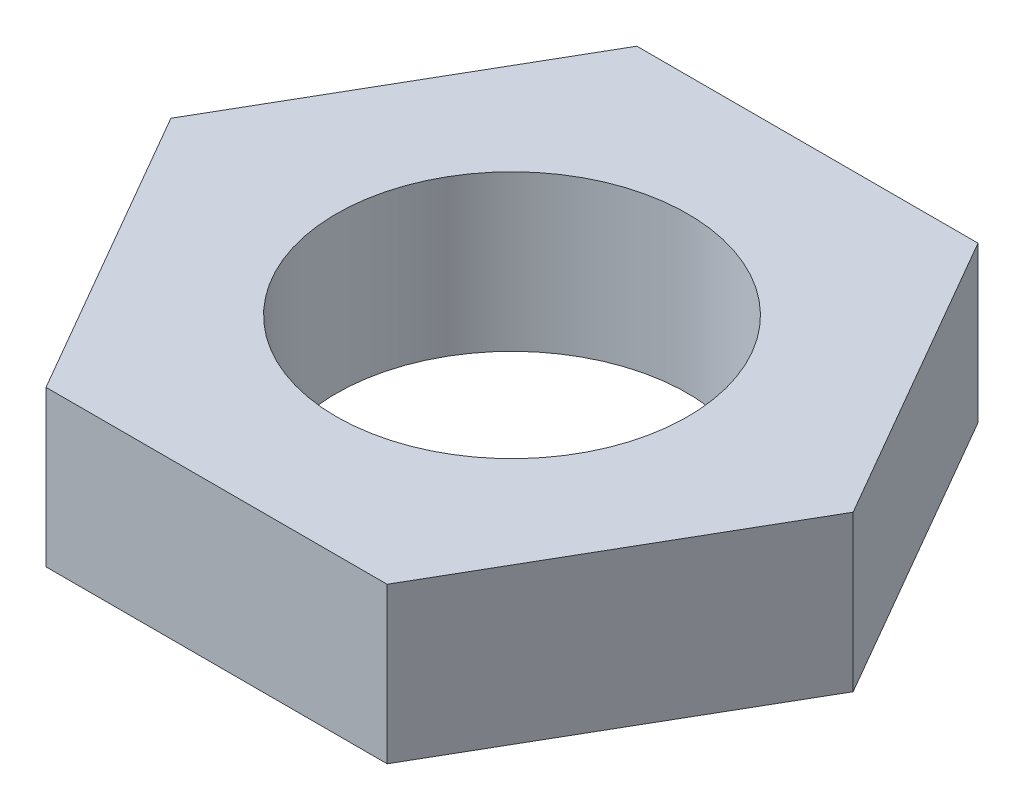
ISO-10303-21;
HEADER;
FILE_DESCRIPTION(('STEP AP214'),'2;1');
FILE_NAME('part.step','',(''),(''),'','','');
FILE_SCHEMA(('AUTOMOTIVE_DESIGN { 1 0 10303 214 1 1 1 1 }'));
ENDSEC;
DATA;
#1=APPLICATION_CONTEXT('core data for automotive mechanical design processes');
#2=APPLICATION_PROTOCOL_DEFINITION('international standard','automotive_design',2000,#1);
#3=PRODUCT_CONTEXT('',#1,'mechanical');
#4=PRODUCT('Part','Part','',(#3));
#5=PRODUCT_RELATED_PRODUCT_CATEGORY('part','',(#4));
#6=PRODUCT_DEFINITION_FORMATION('','',#4);
#7=PRODUCT_DEFINITION_CONTEXT('part definition',#1,'design');
#8=PRODUCT_DEFINITION('design','',#6,#7);
#9=PRODUCT_DEFINITION_SHAPE('','',#8);
#10=(LENGTH_UNIT() NAMED_UNIT(*) SI_UNIT(.MILLI.,.METRE.));
#11=(NAMED_UNIT(*) PLANE_ANGLE_UNIT() SI_UNIT($,.RADIAN.));
#12=(NAMED_UNIT(*) SI_UNIT($,.STERADIAN.) SOLID_ANGLE_UNIT());
#13=UNCERTAINTY_MEASURE_WITH_UNIT(LENGTH_MEASURE(1.E-05),#10,'distance_accuracy_value','');
#14=(GEOMETRIC_REPRESENTATION_CONTEXT(3) GLOBAL_UNCERTAINTY_ASSIGNED_CONTEXT((#13)) GLOBAL_UNIT_ASSIGNED_CONTEXT((#10,
#11,#12)) REPRESENTATION_CONTEXT('',''));
#15=CARTESIAN_POINT('',(0.,0.,0.));
#16=DIRECTION('',(0.,0.,1.));
#17=DIRECTION('',(1.,0.,0.));
#18=AXIS2_PLACEMENT_3D('',#15,#16,#17);
#19=CARTESIAN_POINT('',(5.48482755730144,5.,9.5));
#20=DIRECTION('',(0.,1.,0.));
#21=DIRECTION('',(0.,0.,1.));
#22=AXIS2_PLACEMENT_3D('',#19,#20,#21);
#23=PLANE('',#22);
#24=DIRECTION('',(1.,0.,0.));
#25=VECTOR('',#24,1.);
#26=CARTESIAN_POINT('',(-5.48482755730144,5.,9.5));
#27=LINE('',#26,#25);
#28=CARTESIAN_POINT('',(-5.48482755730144,5.,9.5));
#29=VERTEX_POINT('',#28);
#30=CARTESIAN_POINT('',(5.48482755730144,5.,9.5));
#31=VERTEX_POINT('',#30);
#32=EDGE_CURVE('E133',#29,#31,#27,.T.);
#33=ORIENTED_EDGE('',*,*,#32,.T.);
#34=DIRECTION('',(0.5,0.,-0.866025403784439));
#35=VECTOR('',#34,1.);
#36=CARTESIAN_POINT('',(5.48482755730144,5.,9.5));
#37=LINE('',#36,#35);
#38=CARTESIAN_POINT('',(10.9696551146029,5.,0.));
#39=VERTEX_POINT('',#38);
#40=EDGE_CURVE('E91',#31,#39,#37,.T.);
#41=ORIENTED_EDGE('',*,*,#40,.T.);
#42=DIRECTION('',(-0.5,0.,-0.866025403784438));
#43=VECTOR('',#42,1.);
#44=CARTESIAN_POINT('',(10.9696551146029,5.,0.));
#45=LINE('',#44,#43);
#46=CARTESIAN_POINT('',(5.48482755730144,5.,-9.5));
#47=VERTEX_POINT('',#46);
#48=EDGE_CURVE('E104',#39,#47,#45,.T.);
#49=ORIENTED_EDGE('',*,*,#48,.T.);
#50=DIRECTION('',(-1.,0.,0.));
#51=VECTOR('',#50,1.);
#52=CARTESIAN_POINT('',(5.48482755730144,5.,-9.5));
#53=LINE('',#52,#51);
#54=CARTESIAN_POINT('',(-5.48482755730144,5.,-9.5));
#55=VERTEX_POINT('',#54);
#56=EDGE_CURVE('E98',#47,#55,#53,.T.);
#57=ORIENTED_EDGE('',*,*,#56,.T.);
#58=DIRECTION('',(-0.5,0.,0.866025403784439));
#59=VECTOR('',#58,1.);
#60=CARTESIAN_POINT('',(-5.48482755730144,5.,-9.5));
#61=LINE('',#60,#59);
#62=CARTESIAN_POINT('',(-10.9696551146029,5.,0.));
#63=VERTEX_POINT('',#62);
#64=EDGE_CURVE('E102',#55,#63,#61,.T.);
#65=ORIENTED_EDGE('',*,*,#64,.T.);
#66=DIRECTION('',(0.5,0.,0.866025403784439));
#67=VECTOR('',#66,1.);
#68=CARTESIAN_POINT('',(-10.9696551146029,5.,0.));
#69=LINE('',#68,#67);
#70=EDGE_CURVE('E54',#63,#29,#69,.T.);
#71=ORIENTED_EDGE('',*,*,#70,.T.);
#72=EDGE_LOOP('',(#33,#41,#49,#57,#65,#71));
#73=FACE_BOUND('',#72,.T.);
#74=CARTESIAN_POINT('',(0.,5.,0.));
#75=DIRECTION('',(0.,1.,0.));
#76=DIRECTION('',(0.,0.,1.));
#77=AXIS2_PLACEMENT_3D('',#74,#75,#76);
#78=CIRCLE('',#77,5.65);
#79=CARTESIAN_POINT('',(0.,5.,5.65));
#80=VERTEX_POINT('',#79);
#81=EDGE_CURVE('E126',#80,#80,#78,.T.);
#82=ORIENTED_EDGE('',*,*,#81,.F.);
#83=EDGE_LOOP('',(#82));
#84=FACE_BOUND('',#83,.T.);
#85=ADVANCED_FACE('F37',(#73,#84),#23,.T.);
#86=CARTESIAN_POINT('',(5.48482755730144,0.,9.5));
#87=DIRECTION('',(0.,1.,0.));
#88=DIRECTION('',(0.,0.,1.));
#89=AXIS2_PLACEMENT_3D('',#86,#87,#88);
#90=PLANE('',#89);
#91=DIRECTION('',(1.,0.,0.));
#92=VECTOR('',#91,1.);
#93=CARTESIAN_POINT('',(-5.48482755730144,0.,9.5));
#94=LINE('',#93,#92);
#95=CARTESIAN_POINT('',(-5.48482755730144,0.,9.5));
#96=VERTEX_POINT('',#95);
#97=CARTESIAN_POINT('',(5.48482755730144,0.,9.5));
#98=VERTEX_POINT('',#97);
#99=EDGE_CURVE('E122',#96,#98,#94,.T.);
#100=ORIENTED_EDGE('',*,*,#99,.F.);
#101=DIRECTION('',(0.5,0.,0.866025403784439));
#102=VECTOR('',#101,1.);
#103=CARTESIAN_POINT('',(-10.9696551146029,0.,0.));
#104=LINE('',#103,#102);
#105=CARTESIAN_POINT('',(-10.9696551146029,0.,0.));
#106=VERTEX_POINT('',#105);
#107=EDGE_CURVE('E83',#106,#96,#104,.T.);
#108=ORIENTED_EDGE('',*,*,#107,.F.);
#109=DIRECTION('',(-0.5,0.,0.866025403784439));
#110=VECTOR('',#109,1.);
#111=CARTESIAN_POINT('',(-5.48482755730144,0.,-9.5));
#112=LINE('',#111,#110);
#113=CARTESIAN_POINT('',(-5.48482755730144,0.,-9.5));
#114=VERTEX_POINT('',#113);
#115=EDGE_CURVE('E77',#114,#106,#112,.T.);
#116=ORIENTED_EDGE('',*,*,#115,.F.);
#117=DIRECTION('',(-1.,0.,0.));
#118=VECTOR('',#117,1.);
#119=CARTESIAN_POINT('',(5.48482755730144,0.,-9.5));
#120=LINE('',#119,#118);
#121=CARTESIAN_POINT('',(5.48482755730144,0.,-9.5));
#122=VERTEX_POINT('',#121);
#123=EDGE_CURVE('E112',#122,#114,#120,.T.);
#124=ORIENTED_EDGE('',*,*,#123,.F.);
#125=DIRECTION('',(-0.5,0.,-0.866025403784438));
#126=VECTOR('',#125,1.);
#127=CARTESIAN_POINT('',(10.9696551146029,0.,0.));
#128=LINE('',#127,#126);
#129=CARTESIAN_POINT('',(10.9696551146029,0.,0.));
#130=VERTEX_POINT('',#129);
#131=EDGE_CURVE('E128',#130,#122,#128,.T.);
#132=ORIENTED_EDGE('',*,*,#131,.F.);
#133=DIRECTION('',(0.5,0.,-0.866025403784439));
#134=VECTOR('',#133,1.);
#135=CARTESIAN_POINT('',(5.48482755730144,0.,9.5));
#136=LINE('',#135,#134);
#137=EDGE_CURVE('E125',#98,#130,#136,.T.);
#138=ORIENTED_EDGE('',*,*,#137,.F.);
#139=EDGE_LOOP('',(#100,#108,#116,#124,#132,#138));
#140=FACE_BOUND('',#139,.T.);
#141=CARTESIAN_POINT('',(0.,0.,0.));
#142=DIRECTION('',(0.,1.,0.));
#143=DIRECTION('',(0.,0.,1.));
#144=AXIS2_PLACEMENT_3D('',#141,#142,#143);
#145=CIRCLE('',#144,5.65);
#146=CARTESIAN_POINT('',(0.,0.,5.65));
#147=VERTEX_POINT('',#146);
#148=EDGE_CURVE('E226',#147,#147,#145,.T.);
#149=ORIENTED_EDGE('',*,*,#148,.T.);
#150=EDGE_LOOP('',(#149));
#151=FACE_BOUND('',#150,.T.);
#152=ADVANCED_FACE('F142',(#140,#151),#90,.F.);
#153=CARTESIAN_POINT('',(-5.48482755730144,5.,9.5));
#154=DIRECTION('',(0.,0.,-1.));
#155=DIRECTION('',(-1.,0.,0.));
#156=AXIS2_PLACEMENT_3D('',#153,#154,#155);
#157=PLANE('',#156);
#158=ORIENTED_EDGE('',*,*,#99,.T.);
#159=DIRECTION('',(0.,-1.,0.));
#160=VECTOR('',#159,1.);
#161=CARTESIAN_POINT('',(5.48482755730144,5.,9.5));
#162=LINE('',#161,#160);
#163=EDGE_CURVE('E11',#31,#98,#162,.T.);
#164=ORIENTED_EDGE('',*,*,#163,.F.);
#165=ORIENTED_EDGE('',*,*,#32,.F.);
#166=DIRECTION('',(0.,-1.,0.));
#167=VECTOR('',#166,1.);
#168=CARTESIAN_POINT('',(-5.48482755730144,5.,9.5));
#169=LINE('',#168,#167);
#170=EDGE_CURVE('E118',#29,#96,#169,.T.);
#171=ORIENTED_EDGE('',*,*,#170,.T.);
#172=EDGE_LOOP('',(#158,#164,#165,#171));
#173=FACE_BOUND('',#172,.T.);
#174=ADVANCED_FACE('F39',(#173),#157,.F.);
#175=CARTESIAN_POINT('',(5.48482755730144,5.,9.5));
#176=DIRECTION('',(-0.866025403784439,0.,-0.5));
#177=DIRECTION('',(-0.5,0.,0.866025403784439));
#178=AXIS2_PLACEMENT_3D('',#175,#176,#177);
#179=PLANE('',#178);
#180=ORIENTED_EDGE('',*,*,#137,.T.);
#181=DIRECTION('',(0.,-1.,0.));
#182=VECTOR('',#181,1.);
#183=CARTESIAN_POINT('',(10.9696551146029,5.,0.));
#184=LINE('',#183,#182);
#185=EDGE_CURVE('E46',#39,#130,#184,.T.);
#186=ORIENTED_EDGE('',*,*,#185,.F.);
#187=ORIENTED_EDGE('',*,*,#40,.F.);
#188=ORIENTED_EDGE('',*,*,#163,.T.);
#189=EDGE_LOOP('',(#180,#186,#187,#188));
#190=FACE_BOUND('',#189,.T.);
#191=ADVANCED_FACE('F167',(#190),#179,.F.);
#192=CARTESIAN_POINT('',(10.9696551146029,5.,0.));
#193=DIRECTION('',(-0.866025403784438,0.,0.5));
#194=DIRECTION('',(0.5,0.,0.866025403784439));
#195=AXIS2_PLACEMENT_3D('',#192,#193,#194);
#196=PLANE('',#195);
#197=ORIENTED_EDGE('',*,*,#131,.T.);
#198=DIRECTION('',(0.,-1.,0.));
#199=VECTOR('',#198,1.);
#200=CARTESIAN_POINT('',(5.48482755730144,5.,-9.5));
#201=LINE('',#200,#199);
#202=EDGE_CURVE('E113',#47,#122,#201,.T.);
#203=ORIENTED_EDGE('',*,*,#202,.F.);
#204=ORIENTED_EDGE('',*,*,#48,.F.);
#205=ORIENTED_EDGE('',*,*,#185,.T.);
#206=EDGE_LOOP('',(#197,#203,#204,#205));
#207=FACE_BOUND('',#206,.T.);
#208=ADVANCED_FACE('F139',(#207),#196,.F.);
#209=CARTESIAN_POINT('',(5.48482755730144,5.,-9.5));
#210=DIRECTION('',(0.,0.,1.));
#211=DIRECTION('',(1.,0.,0.));
#212=AXIS2_PLACEMENT_3D('',#209,#210,#211);
#213=PLANE('',#212);
#214=ORIENTED_EDGE('',*,*,#123,.T.);
#215=DIRECTION('',(0.,-1.,0.));
#216=VECTOR('',#215,1.);
#217=CARTESIAN_POINT('',(-5.48482755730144,5.,-9.5));
#218=LINE('',#217,#216);
#219=EDGE_CURVE('E109',#55,#114,#218,.T.);
#220=ORIENTED_EDGE('',*,*,#219,.F.);
#221=ORIENTED_EDGE('',*,*,#56,.F.);
#222=ORIENTED_EDGE('',*,*,#202,.T.);
#223=EDGE_LOOP('',(#214,#220,#221,#222));
#224=FACE_BOUND('',#223,.T.);
#225=ADVANCED_FACE('F110',(#224),#213,.F.);
#226=CARTESIAN_POINT('',(-5.48482755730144,5.,-9.5));
#227=DIRECTION('',(0.866025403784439,0.,0.5));
#228=DIRECTION('',(0.5,0.,-0.866025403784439));
#229=AXIS2_PLACEMENT_3D('',#226,#227,#228);
#230=PLANE('',#229);
#231=ORIENTED_EDGE('',*,*,#115,.T.);
#232=DIRECTION('',(0.,-1.,0.));
#233=VECTOR('',#232,1.);
#234=CARTESIAN_POINT('',(-10.9696551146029,5.,0.));
#235=LINE('',#234,#233);
#236=EDGE_CURVE('E114',#63,#106,#235,.T.);
#237=ORIENTED_EDGE('',*,*,#236,.F.);
#238=ORIENTED_EDGE('',*,*,#64,.F.);
#239=ORIENTED_EDGE('',*,*,#219,.T.);
#240=EDGE_LOOP('',(#231,#237,#238,#239));
#241=FACE_BOUND('',#240,.T.);
#242=ADVANCED_FACE('F116',(#241),#230,.F.);
#243=CARTESIAN_POINT('',(-10.9696551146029,5.,0.));
#244=DIRECTION('',(0.866025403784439,0.,-0.5));
#245=DIRECTION('',(-0.5,0.,-0.866025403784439));
#246=AXIS2_PLACEMENT_3D('',#243,#244,#245);
#247=PLANE('',#246);
#248=ORIENTED_EDGE('',*,*,#107,.T.);
#249=ORIENTED_EDGE('',*,*,#170,.F.);
#250=ORIENTED_EDGE('',*,*,#70,.F.);
#251=ORIENTED_EDGE('',*,*,#236,.T.);
#252=EDGE_LOOP('',(#248,#249,#250,#251));
#253=FACE_BOUND('',#252,.T.);
#254=ADVANCED_FACE('F147',(#253),#247,.F.);
#255=CARTESIAN_POINT('',(0.,5.,0.));
#256=DIRECTION('',(0.,-1.,0.));
#257=DIRECTION('',(0.,0.,-1.));
#258=AXIS2_PLACEMENT_3D('',#255,#256,#257);
#259=CYLINDRICAL_SURFACE('',#258,5.65);
#260=ORIENTED_EDGE('',*,*,#81,.T.);
#261=EDGE_LOOP('',(#260));
#262=FACE_BOUND('',#261,.T.);
#263=ORIENTED_EDGE('',*,*,#148,.F.);
#264=EDGE_LOOP('',(#263));
#265=FACE_BOUND('',#264,.T.);
#266=ADVANCED_FACE('F149',(#262,#265),#259,.F.);
#267=CLOSED_SHELL('',(#85,#152,#174,#191,#208,#225,#242,#254,#266));
#268=MANIFOLD_SOLID_BREP('B2',#267);
#269=ADVANCED_BREP_SHAPE_REPRESENTATION('',(#18,#268),#14);
#270=SHAPE_DEFINITION_REPRESENTATION(#9,#269);
ENDSEC;
END-ISO-10303-21;
